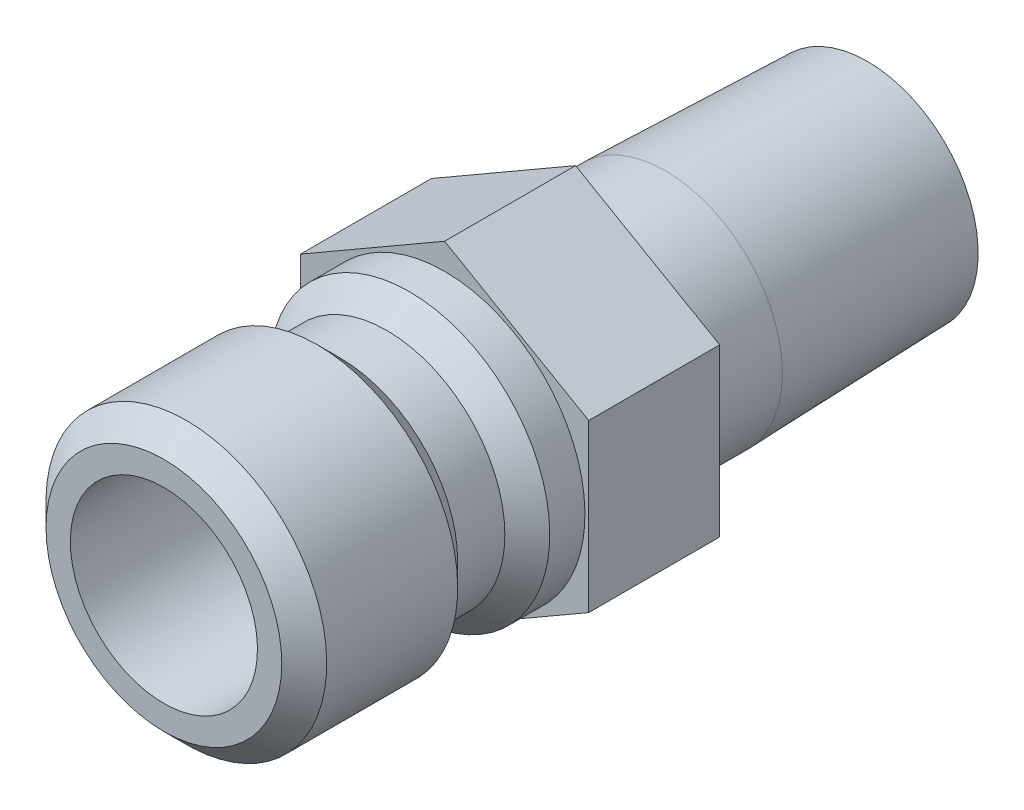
from build123d import *

# Parameters (mm, degrees)
SKETCH2_R           = 3.175
BOSS_EXTRUDE1_DEPTH = 4.445


with BuildPart() as part:
    # Sketch1 → Revolve1 (revolve)
    with BuildSketch(Plane(origin=(0, 0, 0), x_dir=(0, 0, -1), z_dir=(1, 0, 0))):
        Polygon((-9.525, 3.175), (-9.525, 4.0005), (-8.763, 4.7625), (-4.318, 4.7625), (-3.556, 4.0005), (-1.9558, 4.0005), (-1.1938, 4.7625), (0, 4.7625), (0, 3.96875), (7.493, 3.96875), (14.351, 3.754438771), (14.351, 2.38125), (0.127, 2.38125), (0.127, 3.175), align=None)
    revolve(axis=Axis((0, 0, 0), (0, 0, 1)))

    # Sketch2 → Boss-Extrude1 (add)
    with BuildSketch(Plane.XY):
        Polygon((-4.8895, 2.822954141), (-4.8895, -2.822954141), (0, -5.645908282), (4.8895, -2.822954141), (4.8895, 2.822954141), (0, 5.645908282), align=None)
        with Locations(Location((0, 0, 0), (0, 0, 90))):
            Circle(SKETCH2_R, mode=Mode.SUBTRACT)
    extrude(amount=-BOSS_EXTRUDE1_DEPTH)


solid = part.part
